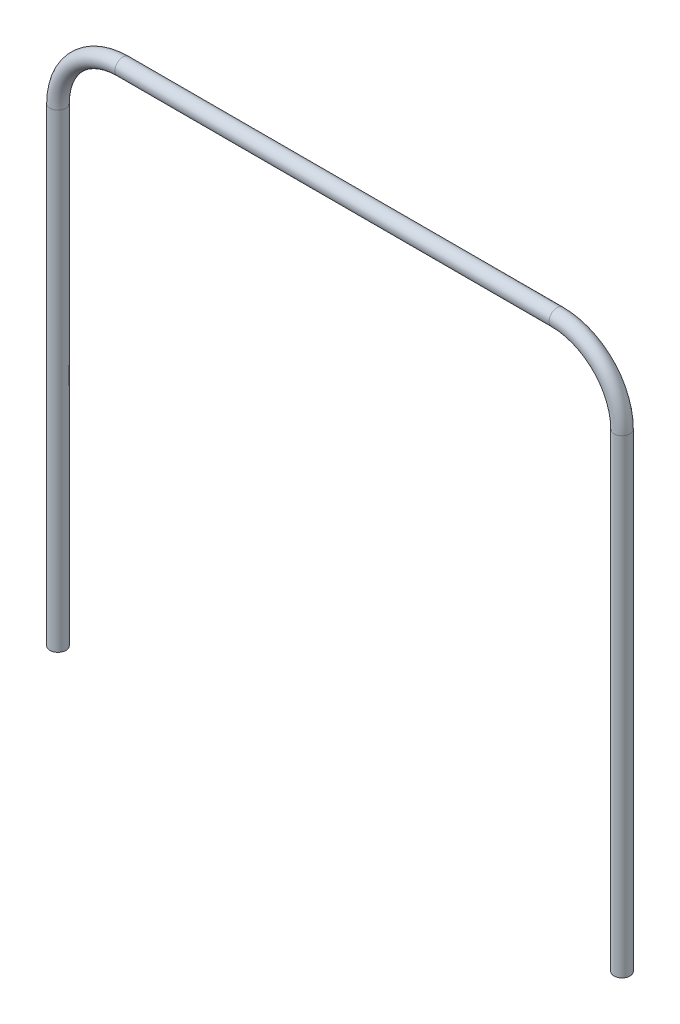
ISO-10303-21;
HEADER;
FILE_DESCRIPTION(('STEP AP214'),'2;1');
FILE_NAME('part.step','',(''),(''),'','','');
FILE_SCHEMA(('AUTOMOTIVE_DESIGN { 1 0 10303 214 1 1 1 1 }'));
ENDSEC;
DATA;
#1=APPLICATION_CONTEXT('core data for automotive mechanical design processes');
#2=APPLICATION_PROTOCOL_DEFINITION('international standard','automotive_design',2000,#1);
#3=PRODUCT_CONTEXT('',#1,'mechanical');
#4=PRODUCT('Part','Part','',(#3));
#5=PRODUCT_RELATED_PRODUCT_CATEGORY('part','',(#4));
#6=PRODUCT_DEFINITION_FORMATION('','',#4);
#7=PRODUCT_DEFINITION_CONTEXT('part definition',#1,'design');
#8=PRODUCT_DEFINITION('design','',#6,#7);
#9=PRODUCT_DEFINITION_SHAPE('','',#8);
#10=(LENGTH_UNIT() NAMED_UNIT(*) SI_UNIT(.MILLI.,.METRE.));
#11=(NAMED_UNIT(*) PLANE_ANGLE_UNIT() SI_UNIT($,.RADIAN.));
#12=(NAMED_UNIT(*) SI_UNIT($,.STERADIAN.) SOLID_ANGLE_UNIT());
#13=UNCERTAINTY_MEASURE_WITH_UNIT(LENGTH_MEASURE(1.E-05),#10,'distance_accuracy_value','');
#14=(GEOMETRIC_REPRESENTATION_CONTEXT(3) GLOBAL_UNCERTAINTY_ASSIGNED_CONTEXT((#13)) GLOBAL_UNIT_ASSIGNED_CONTEXT((#10,
#11,#12)) REPRESENTATION_CONTEXT('',''));
#15=CARTESIAN_POINT('',(0.,0.,0.));
#16=DIRECTION('',(0.,0.,1.));
#17=DIRECTION('',(1.,0.,0.));
#18=AXIS2_PLACEMENT_3D('',#15,#16,#17);
#19=CARTESIAN_POINT('',(564.55,470.,0.));
#20=DIRECTION('',(0.,-1.,0.));
#21=DIRECTION('',(1.,0.,0.));
#22=AXIS2_PLACEMENT_3D('',#19,#20,#21);
#23=CYLINDRICAL_SURFACE('',#22,8.);
#24=CARTESIAN_POINT('',(564.55,470.,0.));
#25=DIRECTION('',(0.,-1.,0.));
#26=DIRECTION('',(0.,0.,1.));
#27=AXIS2_PLACEMENT_3D('',#24,#25,#26);
#28=CIRCLE('',#27,8.);
#29=CARTESIAN_POINT('',(572.55,470.,0.));
#30=VERTEX_POINT('',#29);
#31=EDGE_CURVE('E40',#30,#30,#28,.T.);
#32=ORIENTED_EDGE('',*,*,#31,.T.);
#33=EDGE_LOOP('',(#32));
#34=FACE_BOUND('',#33,.T.);
#35=CARTESIAN_POINT('',(564.55,0.,0.));
#36=DIRECTION('',(0.,-1.,0.));
#37=DIRECTION('',(0.,0.,1.));
#38=AXIS2_PLACEMENT_3D('',#35,#36,#37);
#39=CIRCLE('',#38,8.);
#40=CARTESIAN_POINT('',(564.55,0.,8.));
#41=VERTEX_POINT('',#40);
#42=EDGE_CURVE('E10',#41,#41,#39,.T.);
#43=ORIENTED_EDGE('',*,*,#42,.F.);
#44=EDGE_LOOP('',(#43));
#45=FACE_BOUND('',#44,.T.);
#46=ADVANCED_FACE('F30',(#34,#45),#23,.T.);
#47=CARTESIAN_POINT('',(564.55,470.,0.));
#48=DIRECTION('',(0.,-1.,0.));
#49=DIRECTION('',(1.,0.,0.));
#50=AXIS2_PLACEMENT_3D('',#47,#48,#49);
#51=CYLINDRICAL_SURFACE('',#50,7.);
#52=CARTESIAN_POINT('',(564.55,470.,0.));
#53=DIRECTION('',(0.,-1.,0.));
#54=DIRECTION('',(0.,0.,1.));
#55=AXIS2_PLACEMENT_3D('',#52,#53,#54);
#56=CIRCLE('',#55,7.);
#57=CARTESIAN_POINT('',(571.55,470.,0.));
#58=VERTEX_POINT('',#57);
#59=EDGE_CURVE('E44',#58,#58,#56,.T.);
#60=ORIENTED_EDGE('',*,*,#59,.F.);
#61=EDGE_LOOP('',(#60));
#62=FACE_BOUND('',#61,.T.);
#63=CARTESIAN_POINT('',(564.55,0.,0.));
#64=DIRECTION('',(0.,-1.,0.));
#65=DIRECTION('',(0.,0.,1.));
#66=AXIS2_PLACEMENT_3D('',#63,#64,#65);
#67=CIRCLE('',#66,7.);
#68=CARTESIAN_POINT('',(564.55,0.,7.));
#69=VERTEX_POINT('',#68);
#70=EDGE_CURVE('E36',#69,#69,#67,.T.);
#71=ORIENTED_EDGE('',*,*,#70,.T.);
#72=EDGE_LOOP('',(#71));
#73=FACE_BOUND('',#72,.T.);
#74=ADVANCED_FACE('F94',(#62,#73),#51,.F.);
#75=CARTESIAN_POINT('',(499.55,470.,0.));
#76=DIRECTION('',(0.,0.,-1.));
#77=DIRECTION('',(-1.,0.,0.));
#78=AXIS2_PLACEMENT_3D('',#75,#76,#77);
#79=TOROIDAL_SURFACE('',#78,65.,8.);
#80=CARTESIAN_POINT('',(499.55,535.,0.));
#81=DIRECTION('',(1.,0.,0.));
#82=DIRECTION('',(0.,0.,1.));
#83=AXIS2_PLACEMENT_3D('',#80,#81,#82);
#84=CIRCLE('',#83,8.);
#85=CARTESIAN_POINT('',(499.55,543.,0.));
#86=VERTEX_POINT('',#85);
#87=EDGE_CURVE('E49',#86,#86,#84,.T.);
#88=CARTESIAN_POINT('',(499.55,470.,0.));
#89=DIRECTION('',(0.,0.,-1.));
#90=DIRECTION('',(-1.,0.,0.));
#91=AXIS2_PLACEMENT_3D('',#88,#89,#90);
#92=CIRCLE('',#91,73.);
#93=EDGE_CURVE('',#86,#30,#92,.T.);
#94=ORIENTED_EDGE('',*,*,#87,.T.);
#95=ORIENTED_EDGE('',*,*,#31,.F.);
#96=ORIENTED_EDGE('',*,*,#93,.T.);
#97=ORIENTED_EDGE('',*,*,#93,.F.);
#98=EDGE_LOOP('',(#94,#96,#95,#97));
#99=FACE_BOUND('',#98,.T.);
#100=ADVANCED_FACE('F99',(#99),#79,.T.);
#101=CARTESIAN_POINT('',(499.55,470.,0.));
#102=DIRECTION('',(0.,0.,-1.));
#103=DIRECTION('',(-1.,0.,0.));
#104=AXIS2_PLACEMENT_3D('',#101,#102,#103);
#105=TOROIDAL_SURFACE('',#104,65.,7.);
#106=CARTESIAN_POINT('',(499.55,535.,0.));
#107=DIRECTION('',(1.,0.,0.));
#108=DIRECTION('',(0.,0.,1.));
#109=AXIS2_PLACEMENT_3D('',#106,#107,#108);
#110=CIRCLE('',#109,7.);
#111=CARTESIAN_POINT('',(499.55,542.,0.));
#112=VERTEX_POINT('',#111);
#113=EDGE_CURVE('E52',#112,#112,#110,.T.);
#114=CARTESIAN_POINT('',(499.55,470.,0.));
#115=DIRECTION('',(0.,0.,-1.));
#116=DIRECTION('',(-1.,0.,0.));
#117=AXIS2_PLACEMENT_3D('',#114,#115,#116);
#118=CIRCLE('',#117,72.);
#119=EDGE_CURVE('',#112,#58,#118,.T.);
#120=ORIENTED_EDGE('',*,*,#113,.F.);
#121=ORIENTED_EDGE('',*,*,#59,.T.);
#122=ORIENTED_EDGE('',*,*,#119,.T.);
#123=ORIENTED_EDGE('',*,*,#119,.F.);
#124=EDGE_LOOP('',(#120,#122,#121,#123));
#125=FACE_BOUND('',#124,.T.);
#126=ADVANCED_FACE('F105',(#125),#105,.F.);
#127=CARTESIAN_POINT('',(65.,535.,0.));
#128=DIRECTION('',(1.,0.,0.));
#129=DIRECTION('',(0.,0.,-1.));
#130=AXIS2_PLACEMENT_3D('',#127,#128,#129);
#131=CYLINDRICAL_SURFACE('',#130,8.);
#132=CARTESIAN_POINT('',(65.,535.,0.));
#133=DIRECTION('',(1.,0.,0.));
#134=DIRECTION('',(0.,0.,1.));
#135=AXIS2_PLACEMENT_3D('',#132,#133,#134);
#136=CIRCLE('',#135,8.);
#137=CARTESIAN_POINT('',(65.,543.,0.));
#138=VERTEX_POINT('',#137);
#139=EDGE_CURVE('E55',#138,#138,#136,.T.);
#140=ORIENTED_EDGE('',*,*,#139,.T.);
#141=EDGE_LOOP('',(#140));
#142=FACE_BOUND('',#141,.T.);
#143=ORIENTED_EDGE('',*,*,#87,.F.);
#144=EDGE_LOOP('',(#143));
#145=FACE_BOUND('',#144,.T.);
#146=ADVANCED_FACE('F111',(#142,#145),#131,.T.);
#147=CARTESIAN_POINT('',(65.,535.,0.));
#148=DIRECTION('',(1.,0.,0.));
#149=DIRECTION('',(0.,0.,-1.));
#150=AXIS2_PLACEMENT_3D('',#147,#148,#149);
#151=CYLINDRICAL_SURFACE('',#150,7.);
#152=CARTESIAN_POINT('',(65.,535.,0.));
#153=DIRECTION('',(1.,0.,0.));
#154=DIRECTION('',(0.,0.,1.));
#155=AXIS2_PLACEMENT_3D('',#152,#153,#154);
#156=CIRCLE('',#155,7.);
#157=CARTESIAN_POINT('',(65.,542.,0.));
#158=VERTEX_POINT('',#157);
#159=EDGE_CURVE('E58',#158,#158,#156,.T.);
#160=ORIENTED_EDGE('',*,*,#159,.F.);
#161=EDGE_LOOP('',(#160));
#162=FACE_BOUND('',#161,.T.);
#163=ORIENTED_EDGE('',*,*,#113,.T.);
#164=EDGE_LOOP('',(#163));
#165=FACE_BOUND('',#164,.T.);
#166=ADVANCED_FACE('F117',(#162,#165),#151,.F.);
#167=CARTESIAN_POINT('',(65.,470.,0.));
#168=DIRECTION('',(0.,0.,-1.));
#169=DIRECTION('',(-1.,0.,0.));
#170=AXIS2_PLACEMENT_3D('',#167,#168,#169);
#171=TOROIDAL_SURFACE('',#170,65.,8.);
#172=CARTESIAN_POINT('',(0.,470.,0.));
#173=DIRECTION('',(0.,1.,0.));
#174=DIRECTION('',(0.,0.,1.));
#175=AXIS2_PLACEMENT_3D('',#172,#173,#174);
#176=CIRCLE('',#175,8.);
#177=CARTESIAN_POINT('',(-8.00000000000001,470.,0.));
#178=VERTEX_POINT('',#177);
#179=EDGE_CURVE('E61',#178,#178,#176,.T.);
#180=CARTESIAN_POINT('',(65.,470.,0.));
#181=DIRECTION('',(0.,0.,-1.));
#182=DIRECTION('',(-1.,0.,0.));
#183=AXIS2_PLACEMENT_3D('',#180,#181,#182);
#184=CIRCLE('',#183,73.);
#185=EDGE_CURVE('',#178,#138,#184,.T.);
#186=ORIENTED_EDGE('',*,*,#179,.T.);
#187=ORIENTED_EDGE('',*,*,#139,.F.);
#188=ORIENTED_EDGE('',*,*,#185,.T.);
#189=ORIENTED_EDGE('',*,*,#185,.F.);
#190=EDGE_LOOP('',(#186,#188,#187,#189));
#191=FACE_BOUND('',#190,.T.);
#192=ADVANCED_FACE('F90',(#191),#171,.T.);
#193=CARTESIAN_POINT('',(65.,470.,0.));
#194=DIRECTION('',(0.,0.,-1.));
#195=DIRECTION('',(-1.,0.,0.));
#196=AXIS2_PLACEMENT_3D('',#193,#194,#195);
#197=TOROIDAL_SURFACE('',#196,65.,7.);
#198=CARTESIAN_POINT('',(0.,470.,0.));
#199=DIRECTION('',(0.,1.,0.));
#200=DIRECTION('',(0.,0.,1.));
#201=AXIS2_PLACEMENT_3D('',#198,#199,#200);
#202=CIRCLE('',#201,7.);
#203=CARTESIAN_POINT('',(-7.00000000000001,470.,0.));
#204=VERTEX_POINT('',#203);
#205=EDGE_CURVE('E64',#204,#204,#202,.T.);
#206=CARTESIAN_POINT('',(65.,470.,0.));
#207=DIRECTION('',(0.,0.,-1.));
#208=DIRECTION('',(-1.,0.,0.));
#209=AXIS2_PLACEMENT_3D('',#206,#207,#208);
#210=CIRCLE('',#209,72.);
#211=EDGE_CURVE('',#204,#158,#210,.T.);
#212=ORIENTED_EDGE('',*,*,#205,.F.);
#213=ORIENTED_EDGE('',*,*,#159,.T.);
#214=ORIENTED_EDGE('',*,*,#211,.T.);
#215=ORIENTED_EDGE('',*,*,#211,.F.);
#216=EDGE_LOOP('',(#212,#214,#213,#215));
#217=FACE_BOUND('',#216,.T.);
#218=ADVANCED_FACE('F80',(#217),#197,.F.);
#219=CARTESIAN_POINT('',(0.,470.,0.));
#220=DIRECTION('',(0.,-1.,0.));
#221=DIRECTION('',(0.,0.,-1.));
#222=AXIS2_PLACEMENT_3D('',#219,#220,#221);
#223=CYLINDRICAL_SURFACE('',#222,7.);
#224=ORIENTED_EDGE('',*,*,#205,.T.);
#225=EDGE_LOOP('',(#224));
#226=FACE_BOUND('',#225,.T.);
#227=CARTESIAN_POINT('',(0.,0.,0.));
#228=DIRECTION('',(0.,1.,0.));
#229=DIRECTION('',(0.,0.,1.));
#230=AXIS2_PLACEMENT_3D('',#227,#228,#229);
#231=CIRCLE('',#230,7.);
#232=CARTESIAN_POINT('',(0.,0.,7.));
#233=VERTEX_POINT('',#232);
#234=EDGE_CURVE('E70',#233,#233,#231,.T.);
#235=ORIENTED_EDGE('',*,*,#234,.F.);
#236=EDGE_LOOP('',(#235));
#237=FACE_BOUND('',#236,.T.);
#238=ADVANCED_FACE('F77',(#226,#237),#223,.F.);
#239=CARTESIAN_POINT('',(0.,470.,0.));
#240=DIRECTION('',(0.,-1.,0.));
#241=DIRECTION('',(0.,0.,-1.));
#242=AXIS2_PLACEMENT_3D('',#239,#240,#241);
#243=CYLINDRICAL_SURFACE('',#242,8.);
#244=ORIENTED_EDGE('',*,*,#179,.F.);
#245=EDGE_LOOP('',(#244));
#246=FACE_BOUND('',#245,.T.);
#247=CARTESIAN_POINT('',(0.,0.,0.));
#248=DIRECTION('',(0.,1.,0.));
#249=DIRECTION('',(0.,0.,1.));
#250=AXIS2_PLACEMENT_3D('',#247,#248,#249);
#251=CIRCLE('',#250,8.);
#252=CARTESIAN_POINT('',(0.,0.,8.));
#253=VERTEX_POINT('',#252);
#254=EDGE_CURVE('E67',#253,#253,#251,.T.);
#255=ORIENTED_EDGE('',*,*,#254,.T.);
#256=EDGE_LOOP('',(#255));
#257=FACE_BOUND('',#256,.T.);
#258=ADVANCED_FACE('F79',(#246,#257),#243,.T.);
#259=CARTESIAN_POINT('',(564.55,0.,0.));
#260=DIRECTION('',(0.,-1.,0.));
#261=DIRECTION('',(0.,0.,1.));
#262=AXIS2_PLACEMENT_3D('',#259,#260,#261);
#263=PLANE('',#262);
#264=ORIENTED_EDGE('',*,*,#70,.F.);
#265=EDGE_LOOP('',(#264));
#266=FACE_BOUND('',#265,.T.);
#267=ORIENTED_EDGE('',*,*,#42,.T.);
#268=EDGE_LOOP('',(#267));
#269=FACE_BOUND('',#268,.T.);
#270=ADVANCED_FACE('F87',(#266,#269),#263,.T.);
#271=CARTESIAN_POINT('',(0.,0.,0.));
#272=DIRECTION('',(0.,1.,0.));
#273=DIRECTION('',(0.,0.,1.));
#274=AXIS2_PLACEMENT_3D('',#271,#272,#273);
#275=PLANE('',#274);
#276=ORIENTED_EDGE('',*,*,#234,.T.);
#277=EDGE_LOOP('',(#276));
#278=FACE_BOUND('',#277,.T.);
#279=ORIENTED_EDGE('',*,*,#254,.F.);
#280=EDGE_LOOP('',(#279));
#281=FACE_BOUND('',#280,.T.);
#282=ADVANCED_FACE('F74',(#278,#281),#275,.F.);
#283=CLOSED_SHELL('',(#46,#74,#100,#126,#146,#166,#192,#218,#238,#258,#270,#282));
#284=MANIFOLD_SOLID_BREP('B2',#283);
#285=ADVANCED_BREP_SHAPE_REPRESENTATION('',(#18,#284),#14);
#286=SHAPE_DEFINITION_REPRESENTATION(#9,#285);
ENDSEC;
END-ISO-10303-21;
